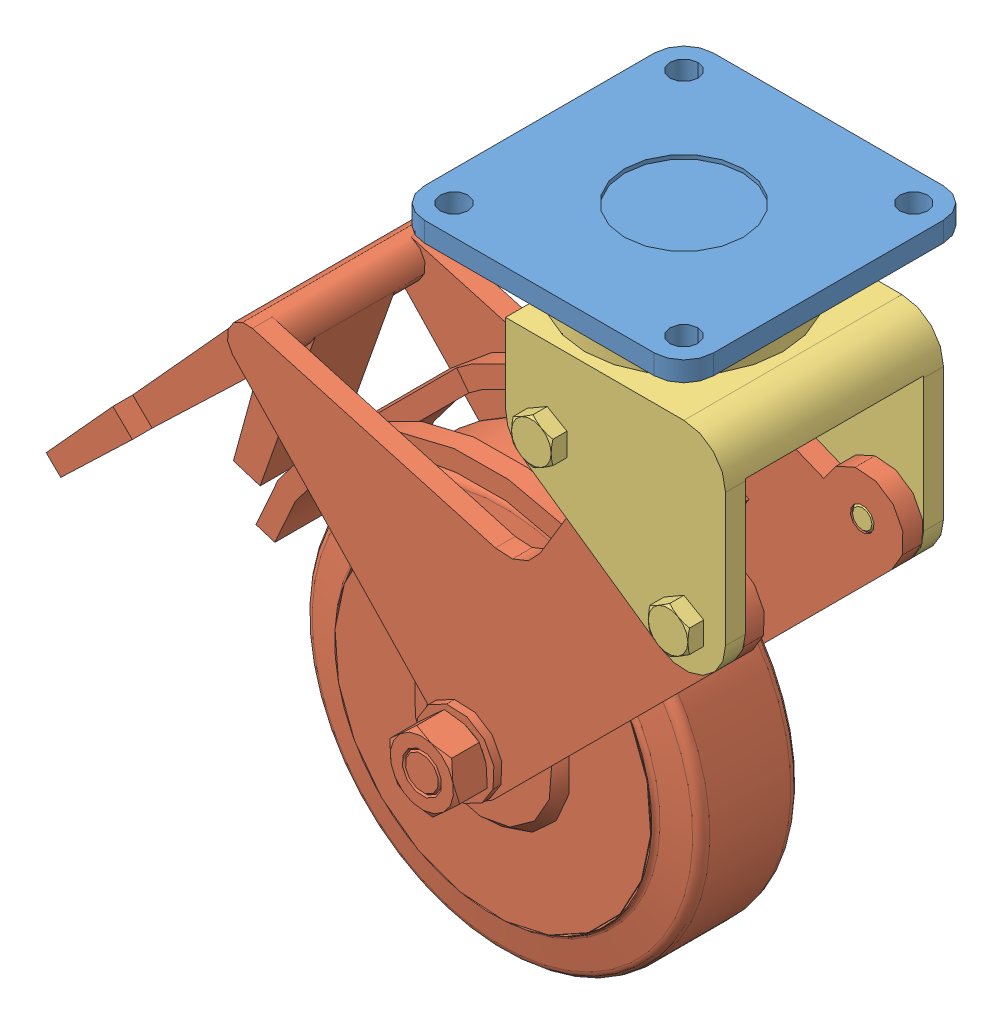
SolidWorks assembly NOUVELLE ROULETTE AR.SLDASM, configuration Default (file format 7000). Lengths in mm.
Overall size (206.09 195.33 73).
3 component instances, 3 part files, 5 mates.
Components (placement in the parent):
- SUPPORT FIXATION ROULETTE AR-1: SUPPORT FIXATION ROULETTE AR.SLDPRT [Default] at origin size (73 20 73)
- NOUVEAU CORPS ROULETTE AR-1: NOUVEAU CORPS ROULETTE AR.SLDPRT [Default] at (-13.3044 -7.5442 0) x (0.975896 0.218238 0) z (0 0 1) size (183 126 65.8)
- SELLETTE ROULETTE AR-1: SELLETTE ROULETTE AR.SLDPRT [Default] at origin size (65.5 68.5 63)
Mates (geometry in assembly coordinates):
- Coaxiale1: concentric: cylinder of NOUVEAU CORPS ROULETTE AR-1 through (27.5 -64 0) axis (0 0 1) radius 3; cylinder of SELLETTE ROULETTE AR-1 through (27.5 -64 27.5) axis (0 0 1) radius 3
- Coïncidente1: coincident: plane of NOUVEAU CORPS ROULETTE AR-1 through (27.5 -64 22.5) normal (0 0 1); plane of SELLETTE ROULETTE AR-1 through (39 -52.75 22.5) normal (0 0 -1)
- Coaxiale2: concentric aligned: cylinder of SUPPORT FIXATION ROULETTE AR-1 through (0 -5 0) axis (0 -1 0) radius 20; cylinder of SELLETTE ROULETTE AR-1 through (0 -6 0) axis (0 -1 0) radius 20
- Coïncidente2: coincident anti-aligned: plane of SUPPORT FIXATION ROULETTE AR-1 through (0 -20 0) normal (0 -1 0); plane of SELLETTE ROULETTE AR-1 through (-17.5 -20 27.5) normal (0 1 0)
- Angle1: planar angle = 0.785398 rad aligned: plane of SELLETTE ROULETTE AR-1 through (38 -64 27.5) normal (1 0 0); plane of NOUVEAU CORPS ROULETTE AR-1 through (-25.7888 -132.1381 22.5) normal (0.707107 -0.707107 0)
